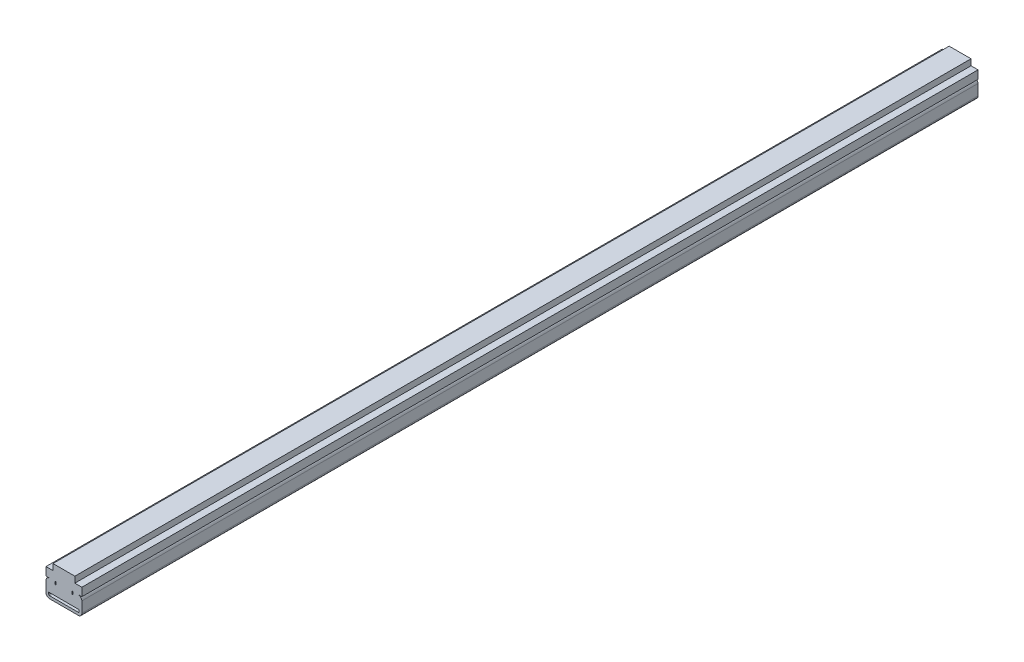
ISO-10303-21;
HEADER;
FILE_DESCRIPTION(('STEP AP214'),'2;1');
FILE_NAME('part.step','',(''),(''),'','','');
FILE_SCHEMA(('AUTOMOTIVE_DESIGN { 1 0 10303 214 1 1 1 1 }'));
ENDSEC;
DATA;
#1=APPLICATION_CONTEXT('core data for automotive mechanical design processes');
#2=APPLICATION_PROTOCOL_DEFINITION('international standard','automotive_design',2000,#1);
#3=PRODUCT_CONTEXT('',#1,'mechanical');
#4=PRODUCT('Part','Part','',(#3));
#5=PRODUCT_RELATED_PRODUCT_CATEGORY('part','',(#4));
#6=PRODUCT_DEFINITION_FORMATION('','',#4);
#7=PRODUCT_DEFINITION_CONTEXT('part definition',#1,'design');
#8=PRODUCT_DEFINITION('design','',#6,#7);
#9=PRODUCT_DEFINITION_SHAPE('','',#8);
#10=(LENGTH_UNIT() NAMED_UNIT(*) SI_UNIT(.MILLI.,.METRE.));
#11=(NAMED_UNIT(*) PLANE_ANGLE_UNIT() SI_UNIT($,.RADIAN.));
#12=(NAMED_UNIT(*) SI_UNIT($,.STERADIAN.) SOLID_ANGLE_UNIT());
#13=UNCERTAINTY_MEASURE_WITH_UNIT(LENGTH_MEASURE(1.E-05),#10,'distance_accuracy_value','');
#14=(GEOMETRIC_REPRESENTATION_CONTEXT(3) GLOBAL_UNCERTAINTY_ASSIGNED_CONTEXT((#13)) GLOBAL_UNIT_ASSIGNED_CONTEXT((#10,
#11,#12)) REPRESENTATION_CONTEXT('',''));
#15=CARTESIAN_POINT('',(0.,0.,0.));
#16=DIRECTION('',(0.,0.,1.));
#17=DIRECTION('',(1.,0.,0.));
#18=AXIS2_PLACEMENT_3D('',#15,#16,#17);
#19=CARTESIAN_POINT('',(-8.,8.,0.));
#20=DIRECTION('',(0.,0.,1.));
#21=DIRECTION('',(1.,0.,0.));
#22=AXIS2_PLACEMENT_3D('',#19,#20,#21);
#23=PLANE('',#22);
#24=DIRECTION('',(0.,-1.,0.));
#25=VECTOR('',#24,1.);
#26=CARTESIAN_POINT('',(8.5,3.,0.));
#27=LINE('',#26,#25);
#28=CARTESIAN_POINT('',(8.5,3.,0.));
#29=VERTEX_POINT('',#28);
#30=CARTESIAN_POINT('',(8.5,2.,0.));
#31=VERTEX_POINT('',#30);
#32=EDGE_CURVE('E278',#29,#31,#27,.T.);
#33=ORIENTED_EDGE('',*,*,#32,.F.);
#34=DIRECTION('',(-1.,0.,0.));
#35=VECTOR('',#34,1.);
#36=CARTESIAN_POINT('',(8.5,3.,0.));
#37=LINE('',#36,#35);
#38=CARTESIAN_POINT('',(-8.5,3.,0.));
#39=VERTEX_POINT('',#38);
#40=EDGE_CURVE('E292',#29,#39,#37,.T.);
#41=ORIENTED_EDGE('',*,*,#40,.T.);
#42=DIRECTION('',(0.,-1.,0.));
#43=VECTOR('',#42,1.);
#44=CARTESIAN_POINT('',(-8.5,3.,0.));
#45=LINE('',#44,#43);
#46=CARTESIAN_POINT('',(-8.5,2.,0.));
#47=VERTEX_POINT('',#46);
#48=EDGE_CURVE('E289',#39,#47,#45,.T.);
#49=ORIENTED_EDGE('',*,*,#48,.T.);
#50=CARTESIAN_POINT('',(-8.,2.,0.));
#51=DIRECTION('',(0.,0.,1.));
#52=DIRECTION('',(1.,0.,0.));
#53=AXIS2_PLACEMENT_3D('',#50,#51,#52);
#54=CIRCLE('',#53,0.5);
#55=CARTESIAN_POINT('',(-8.,1.49999999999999,0.));
#56=VERTEX_POINT('',#55);
#57=EDGE_CURVE('E286',#47,#56,#54,.T.);
#58=ORIENTED_EDGE('',*,*,#57,.T.);
#59=DIRECTION('',(-1.,0.,0.));
#60=VECTOR('',#59,1.);
#61=CARTESIAN_POINT('',(8.,1.5,0.));
#62=LINE('',#61,#60);
#63=CARTESIAN_POINT('',(8.,1.5,0.));
#64=VERTEX_POINT('',#63);
#65=EDGE_CURVE('E284',#64,#56,#62,.T.);
#66=ORIENTED_EDGE('',*,*,#65,.F.);
#67=CARTESIAN_POINT('',(8.,2.,0.));
#68=DIRECTION('',(0.,0.,1.));
#69=DIRECTION('',(1.,0.,0.));
#70=AXIS2_PLACEMENT_3D('',#67,#68,#69);
#71=CIRCLE('',#70,0.5);
#72=EDGE_CURVE('E280',#64,#31,#71,.T.);
#73=ORIENTED_EDGE('',*,*,#72,.T.);
#74=EDGE_LOOP('',(#33,#41,#49,#58,#66,#73));
#75=FACE_BOUND('',#74,.T.);
#76=DIRECTION('',(-1.,0.,0.));
#77=VECTOR('',#76,1.);
#78=CARTESIAN_POINT('',(-6.1,14.6000000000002,0.));
#79=LINE('',#78,#77);
#80=CARTESIAN_POINT('',(-6.1,14.6000000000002,0.));
#81=VERTEX_POINT('',#80);
#82=CARTESIAN_POINT('',(-10.,14.6000000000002,0.));
#83=VERTEX_POINT('',#82);
#84=EDGE_CURVE('E325',#81,#83,#79,.T.);
#85=ORIENTED_EDGE('',*,*,#84,.F.);
#86=DIRECTION('',(0.,-1.,0.));
#87=VECTOR('',#86,1.);
#88=CARTESIAN_POINT('',(-6.1,18.,0.));
#89=LINE('',#88,#87);
#90=CARTESIAN_POINT('',(-6.1,18.,0.));
#91=VERTEX_POINT('',#90);
#92=EDGE_CURVE('E364',#91,#81,#89,.T.);
#93=ORIENTED_EDGE('',*,*,#92,.F.);
#94=DIRECTION('',(-1.,0.,0.));
#95=VECTOR('',#94,1.);
#96=CARTESIAN_POINT('',(6.1,18.,0.));
#97=LINE('',#96,#95);
#98=CARTESIAN_POINT('',(6.1,18.,0.));
#99=VERTEX_POINT('',#98);
#100=EDGE_CURVE('E361',#99,#91,#97,.T.);
#101=ORIENTED_EDGE('',*,*,#100,.F.);
#102=DIRECTION('',(0.,-1.,0.));
#103=VECTOR('',#102,1.);
#104=CARTESIAN_POINT('',(6.1,18.,0.));
#105=LINE('',#104,#103);
#106=CARTESIAN_POINT('',(6.1,14.6000000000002,0.));
#107=VERTEX_POINT('',#106);
#108=EDGE_CURVE('E359',#99,#107,#105,.T.);
#109=ORIENTED_EDGE('',*,*,#108,.T.);
#110=DIRECTION('',(1.,0.,0.));
#111=VECTOR('',#110,1.);
#112=CARTESIAN_POINT('',(6.1,14.6000000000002,0.));
#113=LINE('',#112,#111);
#114=CARTESIAN_POINT('',(10.,14.6000000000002,0.));
#115=VERTEX_POINT('',#114);
#116=EDGE_CURVE('E357',#107,#115,#113,.T.);
#117=ORIENTED_EDGE('',*,*,#116,.T.);
#118=DIRECTION('',(0.,-1.,0.));
#119=VECTOR('',#118,1.);
#120=CARTESIAN_POINT('',(10.,14.6000000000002,0.));
#121=LINE('',#120,#119);
#122=CARTESIAN_POINT('',(10.,10.,0.));
#123=VERTEX_POINT('',#122);
#124=EDGE_CURVE('E355',#115,#123,#121,.T.);
#125=ORIENTED_EDGE('',*,*,#124,.T.);
#126=DIRECTION('',(-1.,0.,0.));
#127=VECTOR('',#126,1.);
#128=CARTESIAN_POINT('',(10.,10.,0.));
#129=LINE('',#128,#127);
#130=CARTESIAN_POINT('',(8.,10.,0.));
#131=VERTEX_POINT('',#130);
#132=EDGE_CURVE('E353',#123,#131,#129,.T.);
#133=ORIENTED_EDGE('',*,*,#132,.T.);
#134=CARTESIAN_POINT('',(8.,8.,0.));
#135=DIRECTION('',(0.,0.,1.));
#136=DIRECTION('',(1.,0.,0.));
#137=AXIS2_PLACEMENT_3D('',#134,#135,#136);
#138=CIRCLE('',#137,2.);
#139=CARTESIAN_POINT('',(10.,8.,0.));
#140=VERTEX_POINT('',#139);
#141=EDGE_CURVE('E350',#140,#131,#138,.T.);
#142=ORIENTED_EDGE('',*,*,#141,.F.);
#143=DIRECTION('',(0.,-1.,0.));
#144=VECTOR('',#143,1.);
#145=CARTESIAN_POINT('',(10.,8.,0.));
#146=LINE('',#145,#144);
#147=CARTESIAN_POINT('',(10.,2.,0.));
#148=VERTEX_POINT('',#147);
#149=EDGE_CURVE('E348',#140,#148,#146,.T.);
#150=ORIENTED_EDGE('',*,*,#149,.T.);
#151=CARTESIAN_POINT('',(8.,2.,0.));
#152=DIRECTION('',(0.,0.,1.));
#153=DIRECTION('',(1.,0.,0.));
#154=AXIS2_PLACEMENT_3D('',#151,#152,#153);
#155=CIRCLE('',#154,2.);
#156=CARTESIAN_POINT('',(8.,0.,0.));
#157=VERTEX_POINT('',#156);
#158=EDGE_CURVE('E345',#157,#148,#155,.T.);
#159=ORIENTED_EDGE('',*,*,#158,.F.);
#160=DIRECTION('',(-1.,0.,0.));
#161=VECTOR('',#160,1.);
#162=CARTESIAN_POINT('',(8.,0.,0.));
#163=LINE('',#162,#161);
#164=CARTESIAN_POINT('',(-8.,0.,0.));
#165=VERTEX_POINT('',#164);
#166=EDGE_CURVE('E343',#157,#165,#163,.T.);
#167=ORIENTED_EDGE('',*,*,#166,.T.);
#168=CARTESIAN_POINT('',(-8.,2.,0.));
#169=DIRECTION('',(0.,0.,1.));
#170=DIRECTION('',(1.,0.,0.));
#171=AXIS2_PLACEMENT_3D('',#168,#169,#170);
#172=CIRCLE('',#171,2.);
#173=CARTESIAN_POINT('',(-10.,2.,0.));
#174=VERTEX_POINT('',#173);
#175=EDGE_CURVE('E340',#174,#165,#172,.T.);
#176=ORIENTED_EDGE('',*,*,#175,.F.);
#177=DIRECTION('',(0.,-1.,0.));
#178=VECTOR('',#177,1.);
#179=CARTESIAN_POINT('',(-10.,8.,0.));
#180=LINE('',#179,#178);
#181=CARTESIAN_POINT('',(-10.,8.,0.));
#182=VERTEX_POINT('',#181);
#183=EDGE_CURVE('E337',#182,#174,#180,.T.);
#184=ORIENTED_EDGE('',*,*,#183,.F.);
#185=CARTESIAN_POINT('',(-8.,8.,0.));
#186=DIRECTION('',(0.,0.,1.));
#187=DIRECTION('',(1.,0.,0.));
#188=AXIS2_PLACEMENT_3D('',#185,#186,#187);
#189=CIRCLE('',#188,2.);
#190=CARTESIAN_POINT('',(-8.,10.,0.));
#191=VERTEX_POINT('',#190);
#192=EDGE_CURVE('E334',#191,#182,#189,.T.);
#193=ORIENTED_EDGE('',*,*,#192,.F.);
#194=DIRECTION('',(-1.,0.,0.));
#195=VECTOR('',#194,1.);
#196=CARTESIAN_POINT('',(-8.,10.,0.));
#197=LINE('',#196,#195);
#198=CARTESIAN_POINT('',(-10.,10.,0.));
#199=VERTEX_POINT('',#198);
#200=EDGE_CURVE('E332',#191,#199,#197,.T.);
#201=ORIENTED_EDGE('',*,*,#200,.T.);
#202=DIRECTION('',(0.,-1.,0.));
#203=VECTOR('',#202,1.);
#204=CARTESIAN_POINT('',(-10.,14.6000000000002,0.));
#205=LINE('',#204,#203);
#206=EDGE_CURVE('E328',#83,#199,#205,.T.);
#207=ORIENTED_EDGE('',*,*,#206,.F.);
#208=EDGE_LOOP('',(#85,#93,#101,#109,#117,#125,#133,#142,#150,#159,#167,#176,#184,#193,#201,#207));
#209=FACE_BOUND('',#208,.T.);
#210=DIRECTION('',(0.,1.,0.));
#211=VECTOR('',#210,1.);
#212=CARTESIAN_POINT('',(5.,8.5,0.));
#213=LINE('',#212,#211);
#214=CARTESIAN_POINT('',(5.,8.5,0.));
#215=VERTEX_POINT('',#214);
#216=CARTESIAN_POINT('',(5.,10.,0.));
#217=VERTEX_POINT('',#216);
#218=EDGE_CURVE('E256',#215,#217,#213,.T.);
#219=ORIENTED_EDGE('',*,*,#218,.T.);
#220=DIRECTION('',(-1.,0.,0.));
#221=VECTOR('',#220,1.);
#222=CARTESIAN_POINT('',(5.,10.,0.));
#223=LINE('',#222,#221);
#224=CARTESIAN_POINT('',(4.5,10.,0.));
#225=VERTEX_POINT('',#224);
#226=EDGE_CURVE('E247',#217,#225,#223,.T.);
#227=ORIENTED_EDGE('',*,*,#226,.T.);
#228=DIRECTION('',(0.,1.,0.));
#229=VECTOR('',#228,1.);
#230=CARTESIAN_POINT('',(4.50000000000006,8.5,0.));
#231=LINE('',#230,#229);
#232=CARTESIAN_POINT('',(4.50000000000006,8.5,0.));
#233=VERTEX_POINT('',#232);
#234=EDGE_CURVE('E250',#233,#225,#231,.T.);
#235=ORIENTED_EDGE('',*,*,#234,.F.);
#236=DIRECTION('',(-1.,0.,0.));
#237=VECTOR('',#236,1.);
#238=CARTESIAN_POINT('',(5.,8.5,0.));
#239=LINE('',#238,#237);
#240=EDGE_CURVE('E253',#215,#233,#239,.T.);
#241=ORIENTED_EDGE('',*,*,#240,.F.);
#242=EDGE_LOOP('',(#219,#227,#235,#241));
#243=FACE_BOUND('',#242,.T.);
#244=DIRECTION('',(-1.,0.,0.));
#245=VECTOR('',#244,1.);
#246=CARTESIAN_POINT('',(-4.5,8.5,0.));
#247=LINE('',#246,#245);
#248=CARTESIAN_POINT('',(-4.5,8.5,0.));
#249=VERTEX_POINT('',#248);
#250=CARTESIAN_POINT('',(-5.,8.5,0.));
#251=VERTEX_POINT('',#250);
#252=EDGE_CURVE('E212',#249,#251,#247,.T.);
#253=ORIENTED_EDGE('',*,*,#252,.F.);
#254=DIRECTION('',(0.,1.,0.));
#255=VECTOR('',#254,1.);
#256=CARTESIAN_POINT('',(-4.5,8.5,0.));
#257=LINE('',#256,#255);
#258=CARTESIAN_POINT('',(-4.5,10.,0.));
#259=VERTEX_POINT('',#258);
#260=EDGE_CURVE('E232',#249,#259,#257,.T.);
#261=ORIENTED_EDGE('',*,*,#260,.T.);
#262=DIRECTION('',(-1.,0.,0.));
#263=VECTOR('',#262,1.);
#264=CARTESIAN_POINT('',(-4.5,10.,0.));
#265=LINE('',#264,#263);
#266=CARTESIAN_POINT('',(-5.,10.,0.));
#267=VERTEX_POINT('',#266);
#268=EDGE_CURVE('E31',#259,#267,#265,.T.);
#269=ORIENTED_EDGE('',*,*,#268,.T.);
#270=DIRECTION('',(0.,1.,0.));
#271=VECTOR('',#270,1.);
#272=CARTESIAN_POINT('',(-5.,8.5,0.));
#273=LINE('',#272,#271);
#274=EDGE_CURVE('E221',#251,#267,#273,.T.);
#275=ORIENTED_EDGE('',*,*,#274,.F.);
#276=EDGE_LOOP('',(#253,#261,#269,#275));
#277=FACE_BOUND('',#276,.T.);
#278=ADVANCED_FACE('F14',(#75,#209,#243,#277),#23,.F.);
#279=CARTESIAN_POINT('',(-8.,8.,500.));
#280=DIRECTION('',(0.,0.,1.));
#281=DIRECTION('',(1.,0.,0.));
#282=AXIS2_PLACEMENT_3D('',#279,#280,#281);
#283=PLANE('',#282);
#284=DIRECTION('',(-1.,0.,0.));
#285=VECTOR('',#284,1.);
#286=CARTESIAN_POINT('',(8.5,3.,500.));
#287=LINE('',#286,#285);
#288=CARTESIAN_POINT('',(8.5,3.,500.));
#289=VERTEX_POINT('',#288);
#290=CARTESIAN_POINT('',(-8.5,3.,500.));
#291=VERTEX_POINT('',#290);
#292=EDGE_CURVE('E281',#289,#291,#287,.T.);
#293=ORIENTED_EDGE('',*,*,#292,.F.);
#294=DIRECTION('',(0.,-1.,0.));
#295=VECTOR('',#294,1.);
#296=CARTESIAN_POINT('',(8.5,3.,500.));
#297=LINE('',#296,#295);
#298=CARTESIAN_POINT('',(8.5,2.,500.));
#299=VERTEX_POINT('',#298);
#300=EDGE_CURVE('E271',#289,#299,#297,.T.);
#301=ORIENTED_EDGE('',*,*,#300,.T.);
#302=CARTESIAN_POINT('',(8.,2.,500.));
#303=DIRECTION('',(0.,0.,1.));
#304=DIRECTION('',(1.,0.,0.));
#305=AXIS2_PLACEMENT_3D('',#302,#303,#304);
#306=CIRCLE('',#305,0.5);
#307=CARTESIAN_POINT('',(8.,1.5,500.));
#308=VERTEX_POINT('',#307);
#309=EDGE_CURVE('E298',#308,#299,#306,.T.);
#310=ORIENTED_EDGE('',*,*,#309,.F.);
#311=DIRECTION('',(-1.,0.,0.));
#312=VECTOR('',#311,1.);
#313=CARTESIAN_POINT('',(8.,1.5,500.));
#314=LINE('',#313,#312);
#315=CARTESIAN_POINT('',(-8.,1.49999999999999,500.));
#316=VERTEX_POINT('',#315);
#317=EDGE_CURVE('E301',#308,#316,#314,.T.);
#318=ORIENTED_EDGE('',*,*,#317,.T.);
#319=CARTESIAN_POINT('',(-8.,2.,500.));
#320=DIRECTION('',(0.,0.,1.));
#321=DIRECTION('',(1.,0.,0.));
#322=AXIS2_PLACEMENT_3D('',#319,#320,#321);
#323=CIRCLE('',#322,0.5);
#324=CARTESIAN_POINT('',(-8.5,2.,500.));
#325=VERTEX_POINT('',#324);
#326=EDGE_CURVE('E304',#325,#316,#323,.T.);
#327=ORIENTED_EDGE('',*,*,#326,.F.);
#328=DIRECTION('',(0.,-1.,0.));
#329=VECTOR('',#328,1.);
#330=CARTESIAN_POINT('',(-8.5,3.,500.));
#331=LINE('',#330,#329);
#332=EDGE_CURVE('E307',#291,#325,#331,.T.);
#333=ORIENTED_EDGE('',*,*,#332,.F.);
#334=EDGE_LOOP('',(#293,#301,#310,#318,#327,#333));
#335=FACE_BOUND('',#334,.T.);
#336=DIRECTION('',(-1.,0.,0.));
#337=VECTOR('',#336,1.);
#338=CARTESIAN_POINT('',(-6.1,14.6000000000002,500.));
#339=LINE('',#338,#337);
#340=CARTESIAN_POINT('',(-6.1,14.6000000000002,500.));
#341=VERTEX_POINT('',#340);
#342=CARTESIAN_POINT('',(-10.,14.6000000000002,500.));
#343=VERTEX_POINT('',#342);
#344=EDGE_CURVE('E324',#341,#343,#339,.T.);
#345=ORIENTED_EDGE('',*,*,#344,.T.);
#346=DIRECTION('',(0.,-1.,0.));
#347=VECTOR('',#346,1.);
#348=CARTESIAN_POINT('',(-10.,14.6000000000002,500.));
#349=LINE('',#348,#347);
#350=CARTESIAN_POINT('',(-10.,10.,500.));
#351=VERTEX_POINT('',#350);
#352=EDGE_CURVE('E369',#343,#351,#349,.T.);
#353=ORIENTED_EDGE('',*,*,#352,.T.);
#354=DIRECTION('',(-1.,0.,0.));
#355=VECTOR('',#354,1.);
#356=CARTESIAN_POINT('',(-8.,10.,500.));
#357=LINE('',#356,#355);
#358=CARTESIAN_POINT('',(-8.,10.,500.));
#359=VERTEX_POINT('',#358);
#360=EDGE_CURVE('E372',#359,#351,#357,.T.);
#361=ORIENTED_EDGE('',*,*,#360,.F.);
#362=CARTESIAN_POINT('',(-8.,8.,500.));
#363=DIRECTION('',(0.,0.,1.));
#364=DIRECTION('',(1.,0.,0.));
#365=AXIS2_PLACEMENT_3D('',#362,#363,#364);
#366=CIRCLE('',#365,2.);
#367=CARTESIAN_POINT('',(-10.,8.,500.));
#368=VERTEX_POINT('',#367);
#369=EDGE_CURVE('E375',#359,#368,#366,.T.);
#370=ORIENTED_EDGE('',*,*,#369,.T.);
#371=DIRECTION('',(0.,-1.,0.));
#372=VECTOR('',#371,1.);
#373=CARTESIAN_POINT('',(-10.,8.,500.));
#374=LINE('',#373,#372);
#375=CARTESIAN_POINT('',(-10.,2.,500.));
#376=VERTEX_POINT('',#375);
#377=EDGE_CURVE('E378',#368,#376,#374,.T.);
#378=ORIENTED_EDGE('',*,*,#377,.T.);
#379=CARTESIAN_POINT('',(-8.,2.,500.));
#380=DIRECTION('',(0.,0.,1.));
#381=DIRECTION('',(1.,0.,0.));
#382=AXIS2_PLACEMENT_3D('',#379,#380,#381);
#383=CIRCLE('',#382,2.);
#384=CARTESIAN_POINT('',(-8.,0.,500.));
#385=VERTEX_POINT('',#384);
#386=EDGE_CURVE('E381',#376,#385,#383,.T.);
#387=ORIENTED_EDGE('',*,*,#386,.T.);
#388=DIRECTION('',(-1.,0.,0.));
#389=VECTOR('',#388,1.);
#390=CARTESIAN_POINT('',(8.,0.,500.));
#391=LINE('',#390,#389);
#392=CARTESIAN_POINT('',(8.,0.,500.));
#393=VERTEX_POINT('',#392);
#394=EDGE_CURVE('E384',#393,#385,#391,.T.);
#395=ORIENTED_EDGE('',*,*,#394,.F.);
#396=CARTESIAN_POINT('',(8.,2.,500.));
#397=DIRECTION('',(0.,0.,1.));
#398=DIRECTION('',(1.,0.,0.));
#399=AXIS2_PLACEMENT_3D('',#396,#397,#398);
#400=CIRCLE('',#399,2.);
#401=CARTESIAN_POINT('',(10.,2.,500.));
#402=VERTEX_POINT('',#401);
#403=EDGE_CURVE('E387',#393,#402,#400,.T.);
#404=ORIENTED_EDGE('',*,*,#403,.T.);
#405=DIRECTION('',(0.,-1.,0.));
#406=VECTOR('',#405,1.);
#407=CARTESIAN_POINT('',(10.,8.,500.));
#408=LINE('',#407,#406);
#409=CARTESIAN_POINT('',(10.,8.,500.));
#410=VERTEX_POINT('',#409);
#411=EDGE_CURVE('E390',#410,#402,#408,.T.);
#412=ORIENTED_EDGE('',*,*,#411,.F.);
#413=CARTESIAN_POINT('',(8.,8.,500.));
#414=DIRECTION('',(0.,0.,1.));
#415=DIRECTION('',(1.,0.,0.));
#416=AXIS2_PLACEMENT_3D('',#413,#414,#415);
#417=CIRCLE('',#416,2.);
#418=CARTESIAN_POINT('',(8.,10.,500.));
#419=VERTEX_POINT('',#418);
#420=EDGE_CURVE('E393',#410,#419,#417,.T.);
#421=ORIENTED_EDGE('',*,*,#420,.T.);
#422=DIRECTION('',(-1.,0.,0.));
#423=VECTOR('',#422,1.);
#424=CARTESIAN_POINT('',(10.,10.,500.));
#425=LINE('',#424,#423);
#426=CARTESIAN_POINT('',(10.,10.,500.));
#427=VERTEX_POINT('',#426);
#428=EDGE_CURVE('E396',#427,#419,#425,.T.);
#429=ORIENTED_EDGE('',*,*,#428,.F.);
#430=DIRECTION('',(0.,-1.,0.));
#431=VECTOR('',#430,1.);
#432=CARTESIAN_POINT('',(10.,14.6000000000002,500.));
#433=LINE('',#432,#431);
#434=CARTESIAN_POINT('',(10.,14.6000000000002,500.));
#435=VERTEX_POINT('',#434);
#436=EDGE_CURVE('E399',#435,#427,#433,.T.);
#437=ORIENTED_EDGE('',*,*,#436,.F.);
#438=DIRECTION('',(1.,0.,0.));
#439=VECTOR('',#438,1.);
#440=CARTESIAN_POINT('',(6.1,14.6000000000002,500.));
#441=LINE('',#440,#439);
#442=CARTESIAN_POINT('',(6.1,14.6000000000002,500.));
#443=VERTEX_POINT('',#442);
#444=EDGE_CURVE('E401',#443,#435,#441,.T.);
#445=ORIENTED_EDGE('',*,*,#444,.F.);
#446=DIRECTION('',(0.,-1.,0.));
#447=VECTOR('',#446,1.);
#448=CARTESIAN_POINT('',(6.1,18.,500.));
#449=LINE('',#448,#447);
#450=CARTESIAN_POINT('',(6.1,18.,500.));
#451=VERTEX_POINT('',#450);
#452=EDGE_CURVE('E403',#451,#443,#449,.T.);
#453=ORIENTED_EDGE('',*,*,#452,.F.);
#454=DIRECTION('',(-1.,0.,0.));
#455=VECTOR('',#454,1.);
#456=CARTESIAN_POINT('',(6.1,18.,500.));
#457=LINE('',#456,#455);
#458=CARTESIAN_POINT('',(-6.1,18.,500.));
#459=VERTEX_POINT('',#458);
#460=EDGE_CURVE('E405',#451,#459,#457,.T.);
#461=ORIENTED_EDGE('',*,*,#460,.T.);
#462=DIRECTION('',(0.,-1.,0.));
#463=VECTOR('',#462,1.);
#464=CARTESIAN_POINT('',(-6.1,18.,500.));
#465=LINE('',#464,#463);
#466=EDGE_CURVE('E329',#459,#341,#465,.T.);
#467=ORIENTED_EDGE('',*,*,#466,.T.);
#468=EDGE_LOOP('',(#345,#353,#361,#370,#378,#387,#395,#404,#412,#421,#429,#437,#445,#453,#461,#467));
#469=FACE_BOUND('',#468,.T.);
#470=DIRECTION('',(-1.,0.,0.));
#471=VECTOR('',#470,1.);
#472=CARTESIAN_POINT('',(5.,10.,500.));
#473=LINE('',#472,#471);
#474=CARTESIAN_POINT('',(5.,10.,500.));
#475=VERTEX_POINT('',#474);
#476=CARTESIAN_POINT('',(4.5,10.,500.));
#477=VERTEX_POINT('',#476);
#478=EDGE_CURVE('E228',#475,#477,#473,.T.);
#479=ORIENTED_EDGE('',*,*,#478,.F.);
#480=DIRECTION('',(0.,1.,0.));
#481=VECTOR('',#480,1.);
#482=CARTESIAN_POINT('',(5.,8.5,500.));
#483=LINE('',#482,#481);
#484=CARTESIAN_POINT('',(5.,8.5,500.));
#485=VERTEX_POINT('',#484);
#486=EDGE_CURVE('E251',#485,#475,#483,.T.);
#487=ORIENTED_EDGE('',*,*,#486,.F.);
#488=DIRECTION('',(-1.,0.,0.));
#489=VECTOR('',#488,1.);
#490=CARTESIAN_POINT('',(5.,8.5,500.));
#491=LINE('',#490,#489);
#492=CARTESIAN_POINT('',(4.50000000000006,8.5,500.));
#493=VERTEX_POINT('',#492);
#494=EDGE_CURVE('E264',#485,#493,#491,.T.);
#495=ORIENTED_EDGE('',*,*,#494,.T.);
#496=DIRECTION('',(0.,1.,0.));
#497=VECTOR('',#496,1.);
#498=CARTESIAN_POINT('',(4.50000000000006,8.5,500.));
#499=LINE('',#498,#497);
#500=EDGE_CURVE('E261',#493,#477,#499,.T.);
#501=ORIENTED_EDGE('',*,*,#500,.T.);
#502=EDGE_LOOP('',(#479,#487,#495,#501));
#503=FACE_BOUND('',#502,.T.);
#504=DIRECTION('',(0.,1.,0.));
#505=VECTOR('',#504,1.);
#506=CARTESIAN_POINT('',(-4.5,8.5,500.));
#507=LINE('',#506,#505);
#508=CARTESIAN_POINT('',(-4.5,8.5,500.));
#509=VERTEX_POINT('',#508);
#510=CARTESIAN_POINT('',(-4.5,10.,500.));
#511=VERTEX_POINT('',#510);
#512=EDGE_CURVE('E222',#509,#511,#507,.T.);
#513=ORIENTED_EDGE('',*,*,#512,.F.);
#514=DIRECTION('',(-1.,0.,0.));
#515=VECTOR('',#514,1.);
#516=CARTESIAN_POINT('',(-4.5,8.5,500.));
#517=LINE('',#516,#515);
#518=CARTESIAN_POINT('',(-5.,8.5,500.));
#519=VERTEX_POINT('',#518);
#520=EDGE_CURVE('E39',#509,#519,#517,.T.);
#521=ORIENTED_EDGE('',*,*,#520,.T.);
#522=DIRECTION('',(0.,1.,0.));
#523=VECTOR('',#522,1.);
#524=CARTESIAN_POINT('',(-5.,8.5,500.));
#525=LINE('',#524,#523);
#526=CARTESIAN_POINT('',(-5.,10.,500.));
#527=VERTEX_POINT('',#526);
#528=EDGE_CURVE('E227',#519,#527,#525,.T.);
#529=ORIENTED_EDGE('',*,*,#528,.T.);
#530=DIRECTION('',(-1.,0.,0.));
#531=VECTOR('',#530,1.);
#532=CARTESIAN_POINT('',(-4.5,10.,500.));
#533=LINE('',#532,#531);
#534=EDGE_CURVE('E238',#511,#527,#533,.T.);
#535=ORIENTED_EDGE('',*,*,#534,.F.);
#536=EDGE_LOOP('',(#513,#521,#529,#535));
#537=FACE_BOUND('',#536,.T.);
#538=ADVANCED_FACE('F448',(#335,#469,#503,#537),#283,.T.);
#539=CARTESIAN_POINT('',(-6.1,14.6000000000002,0.));
#540=DIRECTION('',(0.,1.,0.));
#541=DIRECTION('',(-1.,0.,0.));
#542=AXIS2_PLACEMENT_3D('',#539,#540,#541);
#543=PLANE('',#542);
#544=ORIENTED_EDGE('',*,*,#344,.F.);
#545=DIRECTION('',(0.,0.,1.));
#546=VECTOR('',#545,1.);
#547=CARTESIAN_POINT('',(-6.1,14.6000000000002,0.));
#548=LINE('',#547,#546);
#549=EDGE_CURVE('E9',#81,#341,#548,.T.);
#550=ORIENTED_EDGE('',*,*,#549,.F.);
#551=ORIENTED_EDGE('',*,*,#84,.T.);
#552=DIRECTION('',(0.,0.,1.));
#553=VECTOR('',#552,1.);
#554=CARTESIAN_POINT('',(-10.,14.6000000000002,0.));
#555=LINE('',#554,#553);
#556=EDGE_CURVE('E18',#83,#343,#555,.T.);
#557=ORIENTED_EDGE('',*,*,#556,.T.);
#558=EDGE_LOOP('',(#544,#550,#551,#557));
#559=FACE_BOUND('',#558,.T.);
#560=ADVANCED_FACE('F16',(#559),#543,.T.);
#561=CARTESIAN_POINT('',(-6.1,18.,0.));
#562=DIRECTION('',(-1.,0.,0.));
#563=DIRECTION('',(0.,0.,1.));
#564=AXIS2_PLACEMENT_3D('',#561,#562,#563);
#565=PLANE('',#564);
#566=ORIENTED_EDGE('',*,*,#466,.F.);
#567=DIRECTION('',(0.,0.,1.));
#568=VECTOR('',#567,1.);
#569=CARTESIAN_POINT('',(-6.1,18.,0.));
#570=LINE('',#569,#568);
#571=EDGE_CURVE('E23',#91,#459,#570,.T.);
#572=ORIENTED_EDGE('',*,*,#571,.F.);
#573=ORIENTED_EDGE('',*,*,#92,.T.);
#574=ORIENTED_EDGE('',*,*,#549,.T.);
#575=EDGE_LOOP('',(#566,#572,#573,#574));
#576=FACE_BOUND('',#575,.T.);
#577=ADVANCED_FACE('F454',(#576),#565,.T.);
#578=CARTESIAN_POINT('',(6.1,18.,0.));
#579=DIRECTION('',(0.,1.,0.));
#580=DIRECTION('',(0.,0.,1.));
#581=AXIS2_PLACEMENT_3D('',#578,#579,#580);
#582=PLANE('',#581);
#583=ORIENTED_EDGE('',*,*,#460,.F.);
#584=DIRECTION('',(0.,0.,1.));
#585=VECTOR('',#584,1.);
#586=CARTESIAN_POINT('',(6.1,18.,0.));
#587=LINE('',#586,#585);
#588=EDGE_CURVE('E411',#99,#451,#587,.T.);
#589=ORIENTED_EDGE('',*,*,#588,.F.);
#590=ORIENTED_EDGE('',*,*,#100,.T.);
#591=ORIENTED_EDGE('',*,*,#571,.T.);
#592=EDGE_LOOP('',(#583,#589,#590,#591));
#593=FACE_BOUND('',#592,.T.);
#594=ADVANCED_FACE('F511',(#593),#582,.T.);
#595=CARTESIAN_POINT('',(6.1,18.,0.));
#596=DIRECTION('',(-1.,0.,0.));
#597=DIRECTION('',(0.,0.,1.));
#598=AXIS2_PLACEMENT_3D('',#595,#596,#597);
#599=PLANE('',#598);
#600=ORIENTED_EDGE('',*,*,#452,.T.);
#601=DIRECTION('',(0.,0.,1.));
#602=VECTOR('',#601,1.);
#603=CARTESIAN_POINT('',(6.1,14.6000000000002,0.));
#604=LINE('',#603,#602);
#605=EDGE_CURVE('E413',#107,#443,#604,.T.);
#606=ORIENTED_EDGE('',*,*,#605,.F.);
#607=ORIENTED_EDGE('',*,*,#108,.F.);
#608=ORIENTED_EDGE('',*,*,#588,.T.);
#609=EDGE_LOOP('',(#600,#606,#607,#608));
#610=FACE_BOUND('',#609,.T.);
#611=ADVANCED_FACE('F509',(#610),#599,.F.);
#612=CARTESIAN_POINT('',(6.1,14.6000000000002,0.));
#613=DIRECTION('',(0.,-1.,0.));
#614=DIRECTION('',(0.,0.,-1.));
#615=AXIS2_PLACEMENT_3D('',#612,#613,#614);
#616=PLANE('',#615);
#617=ORIENTED_EDGE('',*,*,#444,.T.);
#618=DIRECTION('',(0.,0.,1.));
#619=VECTOR('',#618,1.);
#620=CARTESIAN_POINT('',(10.,14.6000000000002,0.));
#621=LINE('',#620,#619);
#622=EDGE_CURVE('E416',#115,#435,#621,.T.);
#623=ORIENTED_EDGE('',*,*,#622,.F.);
#624=ORIENTED_EDGE('',*,*,#116,.F.);
#625=ORIENTED_EDGE('',*,*,#605,.T.);
#626=EDGE_LOOP('',(#617,#623,#624,#625));
#627=FACE_BOUND('',#626,.T.);
#628=ADVANCED_FACE('F505',(#627),#616,.F.);
#629=CARTESIAN_POINT('',(10.,14.6000000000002,0.));
#630=DIRECTION('',(-1.,0.,0.));
#631=DIRECTION('',(0.,0.,1.));
#632=AXIS2_PLACEMENT_3D('',#629,#630,#631);
#633=PLANE('',#632);
#634=ORIENTED_EDGE('',*,*,#436,.T.);
#635=DIRECTION('',(0.,0.,1.));
#636=VECTOR('',#635,1.);
#637=CARTESIAN_POINT('',(10.,10.,0.));
#638=LINE('',#637,#636);
#639=EDGE_CURVE('E419',#123,#427,#638,.T.);
#640=ORIENTED_EDGE('',*,*,#639,.F.);
#641=ORIENTED_EDGE('',*,*,#124,.F.);
#642=ORIENTED_EDGE('',*,*,#622,.T.);
#643=EDGE_LOOP('',(#634,#640,#641,#642));
#644=FACE_BOUND('',#643,.T.);
#645=ADVANCED_FACE('F500',(#644),#633,.F.);
#646=CARTESIAN_POINT('',(10.,10.,0.));
#647=DIRECTION('',(0.,1.,0.));
#648=DIRECTION('',(-1.,0.,0.));
#649=AXIS2_PLACEMENT_3D('',#646,#647,#648);
#650=PLANE('',#649);
#651=ORIENTED_EDGE('',*,*,#428,.T.);
#652=DIRECTION('',(0.,0.,1.));
#653=VECTOR('',#652,1.);
#654=CARTESIAN_POINT('',(8.,10.,0.));
#655=LINE('',#654,#653);
#656=EDGE_CURVE('E422',#131,#419,#655,.T.);
#657=ORIENTED_EDGE('',*,*,#656,.F.);
#658=ORIENTED_EDGE('',*,*,#132,.F.);
#659=ORIENTED_EDGE('',*,*,#639,.T.);
#660=EDGE_LOOP('',(#651,#657,#658,#659));
#661=FACE_BOUND('',#660,.T.);
#662=ADVANCED_FACE('F495',(#661),#650,.F.);
#663=CARTESIAN_POINT('',(8.,8.,0.));
#664=DIRECTION('',(0.,0.,1.));
#665=DIRECTION('',(1.,0.,0.));
#666=AXIS2_PLACEMENT_3D('',#663,#664,#665);
#667=CYLINDRICAL_SURFACE('',#666,2.);
#668=ORIENTED_EDGE('',*,*,#420,.F.);
#669=DIRECTION('',(0.,0.,1.));
#670=VECTOR('',#669,1.);
#671=CARTESIAN_POINT('',(10.,8.,0.));
#672=LINE('',#671,#670);
#673=EDGE_CURVE('E424',#140,#410,#672,.T.);
#674=ORIENTED_EDGE('',*,*,#673,.F.);
#675=ORIENTED_EDGE('',*,*,#141,.T.);
#676=ORIENTED_EDGE('',*,*,#656,.T.);
#677=EDGE_LOOP('',(#668,#674,#675,#676));
#678=FACE_BOUND('',#677,.T.);
#679=ADVANCED_FACE('F489',(#678),#667,.T.);
#680=CARTESIAN_POINT('',(10.,8.,0.));
#681=DIRECTION('',(-1.,0.,0.));
#682=DIRECTION('',(0.,0.,1.));
#683=AXIS2_PLACEMENT_3D('',#680,#681,#682);
#684=PLANE('',#683);
#685=ORIENTED_EDGE('',*,*,#411,.T.);
#686=DIRECTION('',(0.,0.,1.));
#687=VECTOR('',#686,1.);
#688=CARTESIAN_POINT('',(10.,2.,0.));
#689=LINE('',#688,#687);
#690=EDGE_CURVE('E426',#148,#402,#689,.T.);
#691=ORIENTED_EDGE('',*,*,#690,.F.);
#692=ORIENTED_EDGE('',*,*,#149,.F.);
#693=ORIENTED_EDGE('',*,*,#673,.T.);
#694=EDGE_LOOP('',(#685,#691,#692,#693));
#695=FACE_BOUND('',#694,.T.);
#696=ADVANCED_FACE('F512',(#695),#684,.F.);
#697=CARTESIAN_POINT('',(8.,2.,0.));
#698=DIRECTION('',(0.,0.,1.));
#699=DIRECTION('',(1.,0.,0.));
#700=AXIS2_PLACEMENT_3D('',#697,#698,#699);
#701=CYLINDRICAL_SURFACE('',#700,2.);
#702=ORIENTED_EDGE('',*,*,#403,.F.);
#703=DIRECTION('',(0.,0.,1.));
#704=VECTOR('',#703,1.);
#705=CARTESIAN_POINT('',(8.,0.,0.));
#706=LINE('',#705,#704);
#707=EDGE_CURVE('E428',#157,#393,#706,.T.);
#708=ORIENTED_EDGE('',*,*,#707,.F.);
#709=ORIENTED_EDGE('',*,*,#158,.T.);
#710=ORIENTED_EDGE('',*,*,#690,.T.);
#711=EDGE_LOOP('',(#702,#708,#709,#710));
#712=FACE_BOUND('',#711,.T.);
#713=ADVANCED_FACE('F482',(#712),#701,.T.);
#714=CARTESIAN_POINT('',(8.,0.,0.));
#715=DIRECTION('',(0.,1.,0.));
#716=DIRECTION('',(-1.,0.,0.));
#717=AXIS2_PLACEMENT_3D('',#714,#715,#716);
#718=PLANE('',#717);
#719=ORIENTED_EDGE('',*,*,#394,.T.);
#720=DIRECTION('',(0.,0.,1.));
#721=VECTOR('',#720,1.);
#722=CARTESIAN_POINT('',(-8.,0.,0.));
#723=LINE('',#722,#721);
#724=EDGE_CURVE('E430',#165,#385,#723,.T.);
#725=ORIENTED_EDGE('',*,*,#724,.F.);
#726=ORIENTED_EDGE('',*,*,#166,.F.);
#727=ORIENTED_EDGE('',*,*,#707,.T.);
#728=EDGE_LOOP('',(#719,#725,#726,#727));
#729=FACE_BOUND('',#728,.T.);
#730=ADVANCED_FACE('F479',(#729),#718,.F.);
#731=CARTESIAN_POINT('',(-8.,2.,0.));
#732=DIRECTION('',(0.,0.,1.));
#733=DIRECTION('',(1.,0.,0.));
#734=AXIS2_PLACEMENT_3D('',#731,#732,#733);
#735=CYLINDRICAL_SURFACE('',#734,2.);
#736=ORIENTED_EDGE('',*,*,#386,.F.);
#737=DIRECTION('',(0.,0.,1.));
#738=VECTOR('',#737,1.);
#739=CARTESIAN_POINT('',(-10.,2.,0.));
#740=LINE('',#739,#738);
#741=EDGE_CURVE('E432',#174,#376,#740,.T.);
#742=ORIENTED_EDGE('',*,*,#741,.F.);
#743=ORIENTED_EDGE('',*,*,#175,.T.);
#744=ORIENTED_EDGE('',*,*,#724,.T.);
#745=EDGE_LOOP('',(#736,#742,#743,#744));
#746=FACE_BOUND('',#745,.T.);
#747=ADVANCED_FACE('F474',(#746),#735,.T.);
#748=CARTESIAN_POINT('',(-10.,8.,0.));
#749=DIRECTION('',(-1.,0.,0.));
#750=DIRECTION('',(0.,0.,1.));
#751=AXIS2_PLACEMENT_3D('',#748,#749,#750);
#752=PLANE('',#751);
#753=ORIENTED_EDGE('',*,*,#377,.F.);
#754=DIRECTION('',(0.,0.,1.));
#755=VECTOR('',#754,1.);
#756=CARTESIAN_POINT('',(-10.,8.,0.));
#757=LINE('',#756,#755);
#758=EDGE_CURVE('E434',#182,#368,#757,.T.);
#759=ORIENTED_EDGE('',*,*,#758,.F.);
#760=ORIENTED_EDGE('',*,*,#183,.T.);
#761=ORIENTED_EDGE('',*,*,#741,.T.);
#762=EDGE_LOOP('',(#753,#759,#760,#761));
#763=FACE_BOUND('',#762,.T.);
#764=ADVANCED_FACE('F469',(#763),#752,.T.);
#765=CARTESIAN_POINT('',(-8.,8.,0.));
#766=DIRECTION('',(0.,0.,1.));
#767=DIRECTION('',(1.,0.,0.));
#768=AXIS2_PLACEMENT_3D('',#765,#766,#767);
#769=CYLINDRICAL_SURFACE('',#768,2.);
#770=ORIENTED_EDGE('',*,*,#369,.F.);
#771=DIRECTION('',(0.,0.,1.));
#772=VECTOR('',#771,1.);
#773=CARTESIAN_POINT('',(-8.,10.,0.));
#774=LINE('',#773,#772);
#775=EDGE_CURVE('E436',#191,#359,#774,.T.);
#776=ORIENTED_EDGE('',*,*,#775,.F.);
#777=ORIENTED_EDGE('',*,*,#192,.T.);
#778=ORIENTED_EDGE('',*,*,#758,.T.);
#779=EDGE_LOOP('',(#770,#776,#777,#778));
#780=FACE_BOUND('',#779,.T.);
#781=ADVANCED_FACE('F466',(#780),#769,.T.);
#782=CARTESIAN_POINT('',(-8.,10.,0.));
#783=DIRECTION('',(0.,1.,0.));
#784=DIRECTION('',(-1.,0.,0.));
#785=AXIS2_PLACEMENT_3D('',#782,#783,#784);
#786=PLANE('',#785);
#787=ORIENTED_EDGE('',*,*,#360,.T.);
#788=DIRECTION('',(0.,0.,1.));
#789=VECTOR('',#788,1.);
#790=CARTESIAN_POINT('',(-10.,10.,0.));
#791=LINE('',#790,#789);
#792=EDGE_CURVE('E437',#199,#351,#791,.T.);
#793=ORIENTED_EDGE('',*,*,#792,.F.);
#794=ORIENTED_EDGE('',*,*,#200,.F.);
#795=ORIENTED_EDGE('',*,*,#775,.T.);
#796=EDGE_LOOP('',(#787,#793,#794,#795));
#797=FACE_BOUND('',#796,.T.);
#798=ADVANCED_FACE('F463',(#797),#786,.F.);
#799=CARTESIAN_POINT('',(-10.,14.6000000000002,0.));
#800=DIRECTION('',(-1.,0.,0.));
#801=DIRECTION('',(0.,0.,1.));
#802=AXIS2_PLACEMENT_3D('',#799,#800,#801);
#803=PLANE('',#802);
#804=ORIENTED_EDGE('',*,*,#352,.F.);
#805=ORIENTED_EDGE('',*,*,#556,.F.);
#806=ORIENTED_EDGE('',*,*,#206,.T.);
#807=ORIENTED_EDGE('',*,*,#792,.T.);
#808=EDGE_LOOP('',(#804,#805,#806,#807));
#809=FACE_BOUND('',#808,.T.);
#810=ADVANCED_FACE('F445',(#809),#803,.T.);
#811=CARTESIAN_POINT('',(8.5,3.,0.));
#812=DIRECTION('',(-1.,0.,0.));
#813=DIRECTION('',(0.,0.,1.));
#814=AXIS2_PLACEMENT_3D('',#811,#812,#813);
#815=PLANE('',#814);
#816=ORIENTED_EDGE('',*,*,#300,.F.);
#817=DIRECTION('',(0.,0.,1.));
#818=VECTOR('',#817,1.);
#819=CARTESIAN_POINT('',(8.5,3.,0.));
#820=LINE('',#819,#818);
#821=EDGE_CURVE('E295',#29,#289,#820,.T.);
#822=ORIENTED_EDGE('',*,*,#821,.F.);
#823=ORIENTED_EDGE('',*,*,#32,.T.);
#824=DIRECTION('',(0.,0.,1.));
#825=VECTOR('',#824,1.);
#826=CARTESIAN_POINT('',(8.5,2.,0.));
#827=LINE('',#826,#825);
#828=EDGE_CURVE('E322',#31,#299,#827,.T.);
#829=ORIENTED_EDGE('',*,*,#828,.T.);
#830=EDGE_LOOP('',(#816,#822,#823,#829));
#831=FACE_BOUND('',#830,.T.);
#832=ADVANCED_FACE('F534',(#831),#815,.T.);
#833=CARTESIAN_POINT('',(8.,2.,0.));
#834=DIRECTION('',(0.,0.,1.));
#835=DIRECTION('',(1.,0.,0.));
#836=AXIS2_PLACEMENT_3D('',#833,#834,#835);
#837=CYLINDRICAL_SURFACE('',#836,0.5);
#838=ORIENTED_EDGE('',*,*,#309,.T.);
#839=ORIENTED_EDGE('',*,*,#828,.F.);
#840=ORIENTED_EDGE('',*,*,#72,.F.);
#841=DIRECTION('',(0.,0.,1.));
#842=VECTOR('',#841,1.);
#843=CARTESIAN_POINT('',(8.,1.5,0.));
#844=LINE('',#843,#842);
#845=EDGE_CURVE('E320',#64,#308,#844,.T.);
#846=ORIENTED_EDGE('',*,*,#845,.T.);
#847=EDGE_LOOP('',(#838,#839,#840,#846));
#848=FACE_BOUND('',#847,.T.);
#849=ADVANCED_FACE('F729',(#848),#837,.F.);
#850=CARTESIAN_POINT('',(8.,1.5,0.));
#851=DIRECTION('',(0.,1.,0.));
#852=DIRECTION('',(-1.,0.,0.));
#853=AXIS2_PLACEMENT_3D('',#850,#851,#852);
#854=PLANE('',#853);
#855=ORIENTED_EDGE('',*,*,#317,.F.);
#856=ORIENTED_EDGE('',*,*,#845,.F.);
#857=ORIENTED_EDGE('',*,*,#65,.T.);
#858=DIRECTION('',(0.,0.,1.));
#859=VECTOR('',#858,1.);
#860=CARTESIAN_POINT('',(-8.,1.49999999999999,0.));
#861=LINE('',#860,#859);
#862=EDGE_CURVE('E318',#56,#316,#861,.T.);
#863=ORIENTED_EDGE('',*,*,#862,.T.);
#864=EDGE_LOOP('',(#855,#856,#857,#863));
#865=FACE_BOUND('',#864,.T.);
#866=ADVANCED_FACE('F719',(#865),#854,.T.);
#867=CARTESIAN_POINT('',(-8.,2.,0.));
#868=DIRECTION('',(0.,0.,1.));
#869=DIRECTION('',(1.,0.,0.));
#870=AXIS2_PLACEMENT_3D('',#867,#868,#869);
#871=CYLINDRICAL_SURFACE('',#870,0.5);
#872=ORIENTED_EDGE('',*,*,#326,.T.);
#873=ORIENTED_EDGE('',*,*,#862,.F.);
#874=ORIENTED_EDGE('',*,*,#57,.F.);
#875=DIRECTION('',(0.,0.,1.));
#876=VECTOR('',#875,1.);
#877=CARTESIAN_POINT('',(-8.5,2.,0.));
#878=LINE('',#877,#876);
#879=EDGE_CURVE('E316',#47,#325,#878,.T.);
#880=ORIENTED_EDGE('',*,*,#879,.T.);
#881=EDGE_LOOP('',(#872,#873,#874,#880));
#882=FACE_BOUND('',#881,.T.);
#883=ADVANCED_FACE('F709',(#882),#871,.F.);
#884=CARTESIAN_POINT('',(-8.5,3.,0.));
#885=DIRECTION('',(-1.,0.,0.));
#886=DIRECTION('',(0.,0.,1.));
#887=AXIS2_PLACEMENT_3D('',#884,#885,#886);
#888=PLANE('',#887);
#889=ORIENTED_EDGE('',*,*,#332,.T.);
#890=ORIENTED_EDGE('',*,*,#879,.F.);
#891=ORIENTED_EDGE('',*,*,#48,.F.);
#892=DIRECTION('',(0.,0.,1.));
#893=VECTOR('',#892,1.);
#894=CARTESIAN_POINT('',(-8.5,3.,0.));
#895=LINE('',#894,#893);
#896=EDGE_CURVE('E314',#39,#291,#895,.T.);
#897=ORIENTED_EDGE('',*,*,#896,.T.);
#898=EDGE_LOOP('',(#889,#890,#891,#897));
#899=FACE_BOUND('',#898,.T.);
#900=ADVANCED_FACE('F699',(#899),#888,.F.);
#901=CARTESIAN_POINT('',(8.5,3.,0.));
#902=DIRECTION('',(0.,1.,0.));
#903=DIRECTION('',(-1.,0.,0.));
#904=AXIS2_PLACEMENT_3D('',#901,#902,#903);
#905=PLANE('',#904);
#906=ORIENTED_EDGE('',*,*,#292,.T.);
#907=ORIENTED_EDGE('',*,*,#896,.F.);
#908=ORIENTED_EDGE('',*,*,#40,.F.);
#909=ORIENTED_EDGE('',*,*,#821,.T.);
#910=EDGE_LOOP('',(#906,#907,#908,#909));
#911=FACE_BOUND('',#910,.T.);
#912=ADVANCED_FACE('F689',(#911),#905,.F.);
#913=CARTESIAN_POINT('',(5.,10.,0.));
#914=DIRECTION('',(0.,1.,0.));
#915=DIRECTION('',(0.,0.,1.));
#916=AXIS2_PLACEMENT_3D('',#913,#914,#915);
#917=PLANE('',#916);
#918=ORIENTED_EDGE('',*,*,#478,.T.);
#919=DIRECTION('',(0.,0.,1.));
#920=VECTOR('',#919,1.);
#921=CARTESIAN_POINT('',(4.5,10.,0.));
#922=LINE('',#921,#920);
#923=EDGE_CURVE('E259',#225,#477,#922,.T.);
#924=ORIENTED_EDGE('',*,*,#923,.F.);
#925=ORIENTED_EDGE('',*,*,#226,.F.);
#926=DIRECTION('',(0.,0.,1.));
#927=VECTOR('',#926,1.);
#928=CARTESIAN_POINT('',(5.,10.,0.));
#929=LINE('',#928,#927);
#930=EDGE_CURVE('E269',#217,#475,#929,.T.);
#931=ORIENTED_EDGE('',*,*,#930,.T.);
#932=EDGE_LOOP('',(#918,#924,#925,#931));
#933=FACE_BOUND('',#932,.T.);
#934=ADVANCED_FACE('F679',(#933),#917,.F.);
#935=CARTESIAN_POINT('',(5.,8.5,0.));
#936=DIRECTION('',(1.,0.,0.));
#937=DIRECTION('',(0.,0.,-1.));
#938=AXIS2_PLACEMENT_3D('',#935,#936,#937);
#939=PLANE('',#938);
#940=ORIENTED_EDGE('',*,*,#486,.T.);
#941=ORIENTED_EDGE('',*,*,#930,.F.);
#942=ORIENTED_EDGE('',*,*,#218,.F.);
#943=DIRECTION('',(0.,0.,1.));
#944=VECTOR('',#943,1.);
#945=CARTESIAN_POINT('',(5.,8.5,0.));
#946=LINE('',#945,#944);
#947=EDGE_CURVE('E272',#215,#485,#946,.T.);
#948=ORIENTED_EDGE('',*,*,#947,.T.);
#949=EDGE_LOOP('',(#940,#941,#942,#948));
#950=FACE_BOUND('',#949,.T.);
#951=ADVANCED_FACE('F669',(#950),#939,.F.);
#952=CARTESIAN_POINT('',(5.,8.5,0.));
#953=DIRECTION('',(0.,1.,0.));
#954=DIRECTION('',(-1.,0.,0.));
#955=AXIS2_PLACEMENT_3D('',#952,#953,#954);
#956=PLANE('',#955);
#957=ORIENTED_EDGE('',*,*,#494,.F.);
#958=ORIENTED_EDGE('',*,*,#947,.F.);
#959=ORIENTED_EDGE('',*,*,#240,.T.);
#960=DIRECTION('',(0.,0.,1.));
#961=VECTOR('',#960,1.);
#962=CARTESIAN_POINT('',(4.50000000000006,8.5,0.));
#963=LINE('',#962,#961);
#964=EDGE_CURVE('E274',#233,#493,#963,.T.);
#965=ORIENTED_EDGE('',*,*,#964,.T.);
#966=EDGE_LOOP('',(#957,#958,#959,#965));
#967=FACE_BOUND('',#966,.T.);
#968=ADVANCED_FACE('F659',(#967),#956,.T.);
#969=CARTESIAN_POINT('',(4.50000000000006,8.5,0.));
#970=DIRECTION('',(1.,0.,0.));
#971=DIRECTION('',(0.,1.,0.));
#972=AXIS2_PLACEMENT_3D('',#969,#970,#971);
#973=PLANE('',#972);
#974=ORIENTED_EDGE('',*,*,#500,.F.);
#975=ORIENTED_EDGE('',*,*,#964,.F.);
#976=ORIENTED_EDGE('',*,*,#234,.T.);
#977=ORIENTED_EDGE('',*,*,#923,.T.);
#978=EDGE_LOOP('',(#974,#975,#976,#977));
#979=FACE_BOUND('',#978,.T.);
#980=ADVANCED_FACE('F650',(#979),#973,.T.);
#981=CARTESIAN_POINT('',(-4.5,8.5,0.));
#982=DIRECTION('',(0.,1.,0.));
#983=DIRECTION('',(-1.,0.,0.));
#984=AXIS2_PLACEMENT_3D('',#981,#982,#983);
#985=PLANE('',#984);
#986=ORIENTED_EDGE('',*,*,#520,.F.);
#987=DIRECTION('',(0.,0.,1.));
#988=VECTOR('',#987,1.);
#989=CARTESIAN_POINT('',(-4.5,8.5,0.));
#990=LINE('',#989,#988);
#991=EDGE_CURVE('E216',#249,#509,#990,.T.);
#992=ORIENTED_EDGE('',*,*,#991,.F.);
#993=ORIENTED_EDGE('',*,*,#252,.T.);
#994=DIRECTION('',(0.,0.,1.));
#995=VECTOR('',#994,1.);
#996=CARTESIAN_POINT('',(-5.,8.5,0.));
#997=LINE('',#996,#995);
#998=EDGE_CURVE('E215',#251,#519,#997,.T.);
#999=ORIENTED_EDGE('',*,*,#998,.T.);
#1000=EDGE_LOOP('',(#986,#992,#993,#999));
#1001=FACE_BOUND('',#1000,.T.);
#1002=ADVANCED_FACE('F214',(#1001),#985,.T.);
#1003=CARTESIAN_POINT('',(-5.,8.5,0.));
#1004=DIRECTION('',(1.,0.,0.));
#1005=DIRECTION('',(0.,0.,-1.));
#1006=AXIS2_PLACEMENT_3D('',#1003,#1004,#1005);
#1007=PLANE('',#1006);
#1008=ORIENTED_EDGE('',*,*,#528,.F.);
#1009=ORIENTED_EDGE('',*,*,#998,.F.);
#1010=ORIENTED_EDGE('',*,*,#274,.T.);
#1011=DIRECTION('',(0.,0.,1.));
#1012=VECTOR('',#1011,1.);
#1013=CARTESIAN_POINT('',(-5.,10.,0.));
#1014=LINE('',#1013,#1012);
#1015=EDGE_CURVE('E229',#267,#527,#1014,.T.);
#1016=ORIENTED_EDGE('',*,*,#1015,.T.);
#1017=EDGE_LOOP('',(#1008,#1009,#1010,#1016));
#1018=FACE_BOUND('',#1017,.T.);
#1019=ADVANCED_FACE('F225',(#1018),#1007,.T.);
#1020=CARTESIAN_POINT('',(-4.5,10.,0.));
#1021=DIRECTION('',(0.,1.,0.));
#1022=DIRECTION('',(-1.,0.,0.));
#1023=AXIS2_PLACEMENT_3D('',#1020,#1021,#1022);
#1024=PLANE('',#1023);
#1025=ORIENTED_EDGE('',*,*,#534,.T.);
#1026=ORIENTED_EDGE('',*,*,#1015,.F.);
#1027=ORIENTED_EDGE('',*,*,#268,.F.);
#1028=DIRECTION('',(0.,0.,1.));
#1029=VECTOR('',#1028,1.);
#1030=CARTESIAN_POINT('',(-4.5,10.,0.));
#1031=LINE('',#1030,#1029);
#1032=EDGE_CURVE('E244',#259,#511,#1031,.T.);
#1033=ORIENTED_EDGE('',*,*,#1032,.T.);
#1034=EDGE_LOOP('',(#1025,#1026,#1027,#1033));
#1035=FACE_BOUND('',#1034,.T.);
#1036=ADVANCED_FACE('F624',(#1035),#1024,.F.);
#1037=CARTESIAN_POINT('',(-4.5,8.5,0.));
#1038=DIRECTION('',(1.,0.,0.));
#1039=DIRECTION('',(0.,0.,-1.));
#1040=AXIS2_PLACEMENT_3D('',#1037,#1038,#1039);
#1041=PLANE('',#1040);
#1042=ORIENTED_EDGE('',*,*,#512,.T.);
#1043=ORIENTED_EDGE('',*,*,#1032,.F.);
#1044=ORIENTED_EDGE('',*,*,#260,.F.);
#1045=ORIENTED_EDGE('',*,*,#991,.T.);
#1046=EDGE_LOOP('',(#1042,#1043,#1044,#1045));
#1047=FACE_BOUND('',#1046,.T.);
#1048=ADVANCED_FACE('F619',(#1047),#1041,.F.);
#1049=CLOSED_SHELL('',(#278,#538,#560,#577,#594,#611,#628,#645,#662,#679,#696,#713,#730,#747,
#764,#781,#798,#810,#832,#849,#866,#883,#900,#912,#934,#951,#968,#980,#1002,#1019,#1036,#1048));
#1050=MANIFOLD_SOLID_BREP('B1',#1049);
#1051=ADVANCED_BREP_SHAPE_REPRESENTATION('',(#18,#1050),#14);
#1052=SHAPE_DEFINITION_REPRESENTATION(#9,#1051);
ENDSEC;
END-ISO-10303-21;
